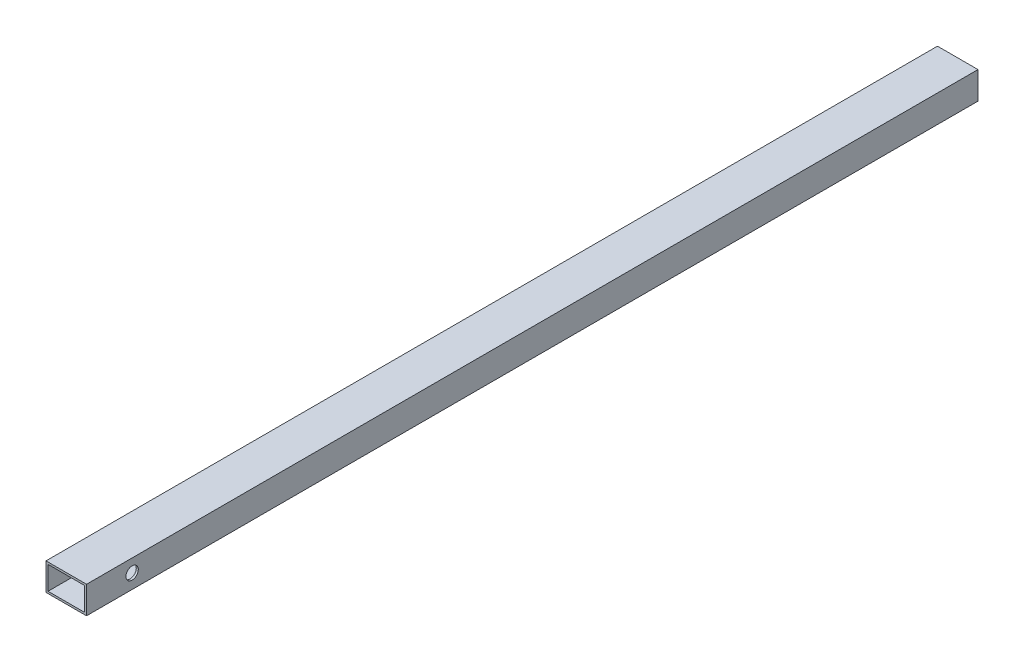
ISO-10303-21;
HEADER;
FILE_DESCRIPTION(('STEP AP214'),'2;1');
FILE_NAME('part.step','',(''),(''),'','','');
FILE_SCHEMA(('AUTOMOTIVE_DESIGN { 1 0 10303 214 1 1 1 1 }'));
ENDSEC;
DATA;
#1=APPLICATION_CONTEXT('core data for automotive mechanical design processes');
#2=APPLICATION_PROTOCOL_DEFINITION('international standard','automotive_design',2000,#1);
#3=PRODUCT_CONTEXT('',#1,'mechanical');
#4=PRODUCT('Part','Part','',(#3));
#5=PRODUCT_RELATED_PRODUCT_CATEGORY('part','',(#4));
#6=PRODUCT_DEFINITION_FORMATION('','',#4);
#7=PRODUCT_DEFINITION_CONTEXT('part definition',#1,'design');
#8=PRODUCT_DEFINITION('design','',#6,#7);
#9=PRODUCT_DEFINITION_SHAPE('','',#8);
#10=(LENGTH_UNIT() NAMED_UNIT(*) SI_UNIT(.MILLI.,.METRE.));
#11=(NAMED_UNIT(*) PLANE_ANGLE_UNIT() SI_UNIT($,.RADIAN.));
#12=(NAMED_UNIT(*) SI_UNIT($,.STERADIAN.) SOLID_ANGLE_UNIT());
#13=UNCERTAINTY_MEASURE_WITH_UNIT(LENGTH_MEASURE(1.E-05),#10,'distance_accuracy_value','');
#14=(GEOMETRIC_REPRESENTATION_CONTEXT(3) GLOBAL_UNCERTAINTY_ASSIGNED_CONTEXT((#13)) GLOBAL_UNIT_ASSIGNED_CONTEXT((#10,
#11,#12)) REPRESENTATION_CONTEXT('',''));
#15=CARTESIAN_POINT('',(0.,0.,0.));
#16=DIRECTION('',(0.,0.,1.));
#17=DIRECTION('',(1.,0.,0.));
#18=AXIS2_PLACEMENT_3D('',#15,#16,#17);
#19=CARTESIAN_POINT('',(38.,-2.,880.));
#20=DIRECTION('',(0.,0.,1.));
#21=DIRECTION('',(1.,0.,0.));
#22=AXIS2_PLACEMENT_3D('',#19,#20,#21);
#23=PLANE('',#22);
#24=DIRECTION('',(1.,0.,0.));
#25=VECTOR('',#24,1.);
#26=CARTESIAN_POINT('',(-2.,-2.,880.));
#27=LINE('',#26,#25);
#28=CARTESIAN_POINT('',(-2.,-2.,880.));
#29=VERTEX_POINT('',#28);
#30=CARTESIAN_POINT('',(38.,-2.,880.));
#31=VERTEX_POINT('',#30);
#32=EDGE_CURVE('E148',#29,#31,#27,.T.);
#33=ORIENTED_EDGE('',*,*,#32,.T.);
#34=DIRECTION('',(0.,1.,0.));
#35=VECTOR('',#34,1.);
#36=CARTESIAN_POINT('',(38.,-2.,880.));
#37=LINE('',#36,#35);
#38=CARTESIAN_POINT('',(38.,25.,880.));
#39=VERTEX_POINT('',#38);
#40=EDGE_CURVE('E151',#31,#39,#37,.T.);
#41=ORIENTED_EDGE('',*,*,#40,.T.);
#42=DIRECTION('',(-1.,0.,0.));
#43=VECTOR('',#42,1.);
#44=CARTESIAN_POINT('',(-2.,25.,880.));
#45=LINE('',#44,#43);
#46=CARTESIAN_POINT('',(-2.,25.,880.));
#47=VERTEX_POINT('',#46);
#48=EDGE_CURVE('E153',#39,#47,#45,.T.);
#49=ORIENTED_EDGE('',*,*,#48,.T.);
#50=DIRECTION('',(0.,-1.,0.));
#51=VECTOR('',#50,1.);
#52=CARTESIAN_POINT('',(-2.,-2.,880.));
#53=LINE('',#52,#51);
#54=EDGE_CURVE('E155',#47,#29,#53,.T.);
#55=ORIENTED_EDGE('',*,*,#54,.T.);
#56=EDGE_LOOP('',(#33,#41,#49,#55));
#57=FACE_BOUND('',#56,.T.);
#58=DIRECTION('',(1.,0.,0.));
#59=VECTOR('',#58,1.);
#60=CARTESIAN_POINT('',(0.,0.,880.));
#61=LINE('',#60,#59);
#62=CARTESIAN_POINT('',(0.,0.,880.));
#63=VERTEX_POINT('',#62);
#64=CARTESIAN_POINT('',(36.,0.,880.));
#65=VERTEX_POINT('',#64);
#66=EDGE_CURVE('E130',#63,#65,#61,.T.);
#67=ORIENTED_EDGE('',*,*,#66,.F.);
#68=DIRECTION('',(0.,-1.,0.));
#69=VECTOR('',#68,1.);
#70=CARTESIAN_POINT('',(0.,0.,880.));
#71=LINE('',#70,#69);
#72=CARTESIAN_POINT('',(0.,23.,880.));
#73=VERTEX_POINT('',#72);
#74=EDGE_CURVE('E115',#73,#63,#71,.T.);
#75=ORIENTED_EDGE('',*,*,#74,.F.);
#76=DIRECTION('',(-1.,0.,0.));
#77=VECTOR('',#76,1.);
#78=CARTESIAN_POINT('',(0.,23.,880.));
#79=LINE('',#78,#77);
#80=CARTESIAN_POINT('',(36.,23.,880.));
#81=VERTEX_POINT('',#80);
#82=EDGE_CURVE('E134',#81,#73,#79,.T.);
#83=ORIENTED_EDGE('',*,*,#82,.F.);
#84=DIRECTION('',(0.,1.,0.));
#85=VECTOR('',#84,1.);
#86=CARTESIAN_POINT('',(36.,0.,880.));
#87=LINE('',#86,#85);
#88=EDGE_CURVE('E132',#65,#81,#87,.T.);
#89=ORIENTED_EDGE('',*,*,#88,.F.);
#90=EDGE_LOOP('',(#67,#75,#83,#89));
#91=FACE_BOUND('',#90,.T.);
#92=ADVANCED_FACE('F34',(#57,#91),#23,.T.);
#93=CARTESIAN_POINT('',(38.,-2.,0.));
#94=DIRECTION('',(0.,0.,1.));
#95=DIRECTION('',(1.,0.,0.));
#96=AXIS2_PLACEMENT_3D('',#93,#94,#95);
#97=PLANE('',#96);
#98=DIRECTION('',(1.,0.,0.));
#99=VECTOR('',#98,1.);
#100=CARTESIAN_POINT('',(-2.,-2.,0.));
#101=LINE('',#100,#99);
#102=CARTESIAN_POINT('',(-2.,-2.,0.));
#103=VERTEX_POINT('',#102);
#104=CARTESIAN_POINT('',(38.,-2.,0.));
#105=VERTEX_POINT('',#104);
#106=EDGE_CURVE('E116',#103,#105,#101,.T.);
#107=ORIENTED_EDGE('',*,*,#106,.F.);
#108=DIRECTION('',(0.,-1.,0.));
#109=VECTOR('',#108,1.);
#110=CARTESIAN_POINT('',(-2.,-2.,0.));
#111=LINE('',#110,#109);
#112=CARTESIAN_POINT('',(-2.,25.,0.));
#113=VERTEX_POINT('',#112);
#114=EDGE_CURVE('E146',#113,#103,#111,.T.);
#115=ORIENTED_EDGE('',*,*,#114,.F.);
#116=DIRECTION('',(-1.,0.,0.));
#117=VECTOR('',#116,1.);
#118=CARTESIAN_POINT('',(-2.,25.,0.));
#119=LINE('',#118,#117);
#120=CARTESIAN_POINT('',(38.,25.,0.));
#121=VERTEX_POINT('',#120);
#122=EDGE_CURVE('E144',#121,#113,#119,.T.);
#123=ORIENTED_EDGE('',*,*,#122,.F.);
#124=DIRECTION('',(0.,1.,0.));
#125=VECTOR('',#124,1.);
#126=CARTESIAN_POINT('',(38.,-2.,0.));
#127=LINE('',#126,#125);
#128=EDGE_CURVE('E142',#105,#121,#127,.T.);
#129=ORIENTED_EDGE('',*,*,#128,.F.);
#130=EDGE_LOOP('',(#107,#115,#123,#129));
#131=FACE_BOUND('',#130,.T.);
#132=DIRECTION('',(0.,-1.,0.));
#133=VECTOR('',#132,1.);
#134=CARTESIAN_POINT('',(0.,0.,0.));
#135=LINE('',#134,#133);
#136=CARTESIAN_POINT('',(0.,23.,0.));
#137=VERTEX_POINT('',#136);
#138=CARTESIAN_POINT('',(0.,0.,0.));
#139=VERTEX_POINT('',#138);
#140=EDGE_CURVE('E58',#137,#139,#135,.T.);
#141=ORIENTED_EDGE('',*,*,#140,.T.);
#142=DIRECTION('',(1.,0.,0.));
#143=VECTOR('',#142,1.);
#144=CARTESIAN_POINT('',(0.,0.,0.));
#145=LINE('',#144,#143);
#146=CARTESIAN_POINT('',(36.,0.,0.));
#147=VERTEX_POINT('',#146);
#148=EDGE_CURVE('E102',#139,#147,#145,.T.);
#149=ORIENTED_EDGE('',*,*,#148,.T.);
#150=DIRECTION('',(0.,1.,0.));
#151=VECTOR('',#150,1.);
#152=CARTESIAN_POINT('',(36.,0.,0.));
#153=LINE('',#152,#151);
#154=CARTESIAN_POINT('',(36.,23.,0.));
#155=VERTEX_POINT('',#154);
#156=EDGE_CURVE('E111',#147,#155,#153,.T.);
#157=ORIENTED_EDGE('',*,*,#156,.T.);
#158=DIRECTION('',(-1.,0.,0.));
#159=VECTOR('',#158,1.);
#160=CARTESIAN_POINT('',(0.,23.,0.));
#161=LINE('',#160,#159);
#162=EDGE_CURVE('E120',#155,#137,#161,.T.);
#163=ORIENTED_EDGE('',*,*,#162,.T.);
#164=EDGE_LOOP('',(#141,#149,#157,#163));
#165=FACE_BOUND('',#164,.T.);
#166=ADVANCED_FACE('F119',(#131,#165),#97,.F.);
#167=CARTESIAN_POINT('',(-2.,-2.,880.));
#168=DIRECTION('',(0.,1.,0.));
#169=DIRECTION('',(0.,0.,1.));
#170=AXIS2_PLACEMENT_3D('',#167,#168,#169);
#171=PLANE('',#170);
#172=ORIENTED_EDGE('',*,*,#106,.T.);
#173=DIRECTION('',(0.,0.,-1.));
#174=VECTOR('',#173,1.);
#175=CARTESIAN_POINT('',(38.,-2.,880.));
#176=LINE('',#175,#174);
#177=EDGE_CURVE('E11',#31,#105,#176,.T.);
#178=ORIENTED_EDGE('',*,*,#177,.F.);
#179=ORIENTED_EDGE('',*,*,#32,.F.);
#180=DIRECTION('',(0.,0.,-1.));
#181=VECTOR('',#180,1.);
#182=CARTESIAN_POINT('',(-2.,-2.,880.));
#183=LINE('',#182,#181);
#184=EDGE_CURVE('E157',#29,#103,#183,.T.);
#185=ORIENTED_EDGE('',*,*,#184,.T.);
#186=EDGE_LOOP('',(#172,#178,#179,#185));
#187=FACE_BOUND('',#186,.T.);
#188=ADVANCED_FACE('F36',(#187),#171,.F.);
#189=CARTESIAN_POINT('',(38.,-2.,880.));
#190=DIRECTION('',(-1.,0.,0.));
#191=DIRECTION('',(0.,0.,1.));
#192=AXIS2_PLACEMENT_3D('',#189,#190,#191);
#193=PLANE('',#192);
#194=CARTESIAN_POINT('',(38.,12.15,835.));
#195=DIRECTION('',(1.,0.,0.));
#196=DIRECTION('',(0.,0.,-1.));
#197=AXIS2_PLACEMENT_3D('',#194,#195,#196);
#198=CIRCLE('',#197,6.10000000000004);
#199=CARTESIAN_POINT('',(38.,12.15,828.9));
#200=VERTEX_POINT('',#199);
#201=EDGE_CURVE('E210',#200,#200,#198,.T.);
#202=ORIENTED_EDGE('',*,*,#201,.F.);
#203=EDGE_LOOP('',(#202));
#204=FACE_BOUND('',#203,.T.);
#205=ORIENTED_EDGE('',*,*,#128,.T.);
#206=DIRECTION('',(0.,0.,-1.));
#207=VECTOR('',#206,1.);
#208=CARTESIAN_POINT('',(38.,25.,880.));
#209=LINE('',#208,#207);
#210=EDGE_CURVE('E43',#39,#121,#209,.T.);
#211=ORIENTED_EDGE('',*,*,#210,.F.);
#212=ORIENTED_EDGE('',*,*,#40,.F.);
#213=ORIENTED_EDGE('',*,*,#177,.T.);
#214=EDGE_LOOP('',(#205,#211,#212,#213));
#215=FACE_BOUND('',#214,.T.);
#216=ADVANCED_FACE('F183',(#204,#215),#193,.F.);
#217=CARTESIAN_POINT('',(-2.,25.,880.));
#218=DIRECTION('',(0.,-1.,0.));
#219=DIRECTION('',(0.,0.,-1.));
#220=AXIS2_PLACEMENT_3D('',#217,#218,#219);
#221=PLANE('',#220);
#222=ORIENTED_EDGE('',*,*,#122,.T.);
#223=DIRECTION('',(0.,0.,-1.));
#224=VECTOR('',#223,1.);
#225=CARTESIAN_POINT('',(-2.,25.,880.));
#226=LINE('',#225,#224);
#227=EDGE_CURVE('E160',#47,#113,#226,.T.);
#228=ORIENTED_EDGE('',*,*,#227,.F.);
#229=ORIENTED_EDGE('',*,*,#48,.F.);
#230=ORIENTED_EDGE('',*,*,#210,.T.);
#231=EDGE_LOOP('',(#222,#228,#229,#230));
#232=FACE_BOUND('',#231,.T.);
#233=ADVANCED_FACE('F168',(#232),#221,.F.);
#234=CARTESIAN_POINT('',(-2.,-2.,880.));
#235=DIRECTION('',(1.,0.,0.));
#236=DIRECTION('',(0.,0.,-1.));
#237=AXIS2_PLACEMENT_3D('',#234,#235,#236);
#238=PLANE('',#237);
#239=CARTESIAN_POINT('',(-2.,12.15,835.));
#240=DIRECTION('',(1.,0.,0.));
#241=DIRECTION('',(0.,0.,-1.));
#242=AXIS2_PLACEMENT_3D('',#239,#240,#241);
#243=CIRCLE('',#242,6.10000000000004);
#244=CARTESIAN_POINT('',(-2.,12.15,828.9));
#245=VERTEX_POINT('',#244);
#246=EDGE_CURVE('E208',#245,#245,#243,.T.);
#247=ORIENTED_EDGE('',*,*,#246,.T.);
#248=EDGE_LOOP('',(#247));
#249=FACE_BOUND('',#248,.T.);
#250=ORIENTED_EDGE('',*,*,#114,.T.);
#251=ORIENTED_EDGE('',*,*,#184,.F.);
#252=ORIENTED_EDGE('',*,*,#54,.F.);
#253=ORIENTED_EDGE('',*,*,#227,.T.);
#254=EDGE_LOOP('',(#250,#251,#252,#253));
#255=FACE_BOUND('',#254,.T.);
#256=ADVANCED_FACE('F176',(#249,#255),#238,.F.);
#257=CARTESIAN_POINT('',(0.,0.,880.));
#258=DIRECTION('',(1.,0.,0.));
#259=DIRECTION('',(0.,0.,-1.));
#260=AXIS2_PLACEMENT_3D('',#257,#258,#259);
#261=PLANE('',#260);
#262=CARTESIAN_POINT('',(0.,12.15,835.));
#263=DIRECTION('',(1.,0.,0.));
#264=DIRECTION('',(0.,0.,-1.));
#265=AXIS2_PLACEMENT_3D('',#262,#263,#264);
#266=CIRCLE('',#265,6.10000000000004);
#267=CARTESIAN_POINT('',(0.,12.15,828.9));
#268=VERTEX_POINT('',#267);
#269=EDGE_CURVE('E121',#268,#268,#266,.T.);
#270=ORIENTED_EDGE('',*,*,#269,.F.);
#271=EDGE_LOOP('',(#270));
#272=FACE_BOUND('',#271,.T.);
#273=ORIENTED_EDGE('',*,*,#140,.F.);
#274=DIRECTION('',(0.,0.,-1.));
#275=VECTOR('',#274,1.);
#276=CARTESIAN_POINT('',(0.,23.,880.));
#277=LINE('',#276,#275);
#278=EDGE_CURVE('E136',#73,#137,#277,.T.);
#279=ORIENTED_EDGE('',*,*,#278,.F.);
#280=ORIENTED_EDGE('',*,*,#74,.T.);
#281=DIRECTION('',(0.,0.,-1.));
#282=VECTOR('',#281,1.);
#283=CARTESIAN_POINT('',(0.,0.,880.));
#284=LINE('',#283,#282);
#285=EDGE_CURVE('E104',#63,#139,#284,.T.);
#286=ORIENTED_EDGE('',*,*,#285,.T.);
#287=EDGE_LOOP('',(#273,#279,#280,#286));
#288=FACE_BOUND('',#287,.T.);
#289=ADVANCED_FACE('F113',(#272,#288),#261,.T.);
#290=CARTESIAN_POINT('',(0.,0.,880.));
#291=DIRECTION('',(0.,1.,0.));
#292=DIRECTION('',(0.,0.,1.));
#293=AXIS2_PLACEMENT_3D('',#290,#291,#292);
#294=PLANE('',#293);
#295=ORIENTED_EDGE('',*,*,#148,.F.);
#296=ORIENTED_EDGE('',*,*,#285,.F.);
#297=ORIENTED_EDGE('',*,*,#66,.T.);
#298=DIRECTION('',(0.,0.,-1.));
#299=VECTOR('',#298,1.);
#300=CARTESIAN_POINT('',(36.,0.,880.));
#301=LINE('',#300,#299);
#302=EDGE_CURVE('E107',#65,#147,#301,.T.);
#303=ORIENTED_EDGE('',*,*,#302,.T.);
#304=EDGE_LOOP('',(#295,#296,#297,#303));
#305=FACE_BOUND('',#304,.T.);
#306=ADVANCED_FACE('F103',(#305),#294,.T.);
#307=CARTESIAN_POINT('',(36.,0.,880.));
#308=DIRECTION('',(-1.,0.,0.));
#309=DIRECTION('',(0.,0.,1.));
#310=AXIS2_PLACEMENT_3D('',#307,#308,#309);
#311=PLANE('',#310);
#312=CARTESIAN_POINT('',(36.,12.15,835.));
#313=DIRECTION('',(-1.,0.,0.));
#314=DIRECTION('',(0.,0.,1.));
#315=AXIS2_PLACEMENT_3D('',#312,#313,#314);
#316=CIRCLE('',#315,6.10000000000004);
#317=CARTESIAN_POINT('',(36.,12.15,841.1));
#318=VERTEX_POINT('',#317);
#319=EDGE_CURVE('E38',#318,#318,#316,.T.);
#320=ORIENTED_EDGE('',*,*,#319,.F.);
#321=EDGE_LOOP('',(#320));
#322=FACE_BOUND('',#321,.T.);
#323=ORIENTED_EDGE('',*,*,#156,.F.);
#324=ORIENTED_EDGE('',*,*,#302,.F.);
#325=ORIENTED_EDGE('',*,*,#88,.T.);
#326=DIRECTION('',(0.,0.,-1.));
#327=VECTOR('',#326,1.);
#328=CARTESIAN_POINT('',(36.,23.,880.));
#329=LINE('',#328,#327);
#330=EDGE_CURVE('E50',#81,#155,#329,.T.);
#331=ORIENTED_EDGE('',*,*,#330,.T.);
#332=EDGE_LOOP('',(#323,#324,#325,#331));
#333=FACE_BOUND('',#332,.T.);
#334=ADVANCED_FACE('F226',(#322,#333),#311,.T.);
#335=CARTESIAN_POINT('',(0.,23.,880.));
#336=DIRECTION('',(0.,-1.,0.));
#337=DIRECTION('',(0.,0.,-1.));
#338=AXIS2_PLACEMENT_3D('',#335,#336,#337);
#339=PLANE('',#338);
#340=ORIENTED_EDGE('',*,*,#162,.F.);
#341=ORIENTED_EDGE('',*,*,#330,.F.);
#342=ORIENTED_EDGE('',*,*,#82,.T.);
#343=ORIENTED_EDGE('',*,*,#278,.T.);
#344=EDGE_LOOP('',(#340,#341,#342,#343));
#345=FACE_BOUND('',#344,.T.);
#346=ADVANCED_FACE('F218',(#345),#339,.T.);
#347=CARTESIAN_POINT('',(-2.,12.15,835.));
#348=DIRECTION('',(1.,0.,0.));
#349=DIRECTION('',(0.,0.,-1.));
#350=AXIS2_PLACEMENT_3D('',#347,#348,#349);
#351=CYLINDRICAL_SURFACE('',#350,6.10000000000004);
#352=ORIENTED_EDGE('',*,*,#319,.T.);
#353=EDGE_LOOP('',(#352));
#354=FACE_BOUND('',#353,.T.);
#355=ORIENTED_EDGE('',*,*,#201,.T.);
#356=EDGE_LOOP('',(#355));
#357=FACE_BOUND('',#356,.T.);
#358=ADVANCED_FACE('F215',(#354,#357),#351,.F.);
#359=ORIENTED_EDGE('',*,*,#269,.T.);
#360=EDGE_LOOP('',(#359));
#361=FACE_BOUND('',#360,.T.);
#362=ORIENTED_EDGE('',*,*,#246,.F.);
#363=EDGE_LOOP('',(#362));
#364=FACE_BOUND('',#363,.T.);
#365=ADVANCED_FACE('F217',(#361,#364),#351,.F.);
#366=CLOSED_SHELL('',(#92,#166,#188,#216,#233,#256,#289,#306,#334,#346,#358,#365));
#367=MANIFOLD_SOLID_BREP('B2',#366);
#368=ADVANCED_BREP_SHAPE_REPRESENTATION('',(#18,#367),#14);
#369=SHAPE_DEFINITION_REPRESENTATION(#9,#368);
ENDSEC;
END-ISO-10303-21;
